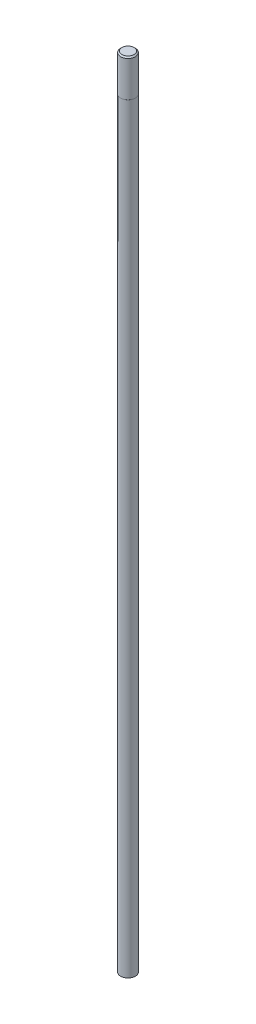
ISO-10303-21;
HEADER;
FILE_DESCRIPTION(('STEP AP214'),'2;1');
FILE_NAME('part.step','',(''),(''),'','','');
FILE_SCHEMA(('AUTOMOTIVE_DESIGN { 1 0 10303 214 1 1 1 1 }'));
ENDSEC;
DATA;
#1=APPLICATION_CONTEXT('core data for automotive mechanical design processes');
#2=APPLICATION_PROTOCOL_DEFINITION('international standard','automotive_design',2000,#1);
#3=PRODUCT_CONTEXT('',#1,'mechanical');
#4=PRODUCT('Part','Part','',(#3));
#5=PRODUCT_RELATED_PRODUCT_CATEGORY('part','',(#4));
#6=PRODUCT_DEFINITION_FORMATION('','',#4);
#7=PRODUCT_DEFINITION_CONTEXT('part definition',#1,'design');
#8=PRODUCT_DEFINITION('design','',#6,#7);
#9=PRODUCT_DEFINITION_SHAPE('','',#8);
#10=(LENGTH_UNIT() NAMED_UNIT(*) SI_UNIT(.MILLI.,.METRE.));
#11=(NAMED_UNIT(*) PLANE_ANGLE_UNIT() SI_UNIT($,.RADIAN.));
#12=(NAMED_UNIT(*) SI_UNIT($,.STERADIAN.) SOLID_ANGLE_UNIT());
#13=UNCERTAINTY_MEASURE_WITH_UNIT(LENGTH_MEASURE(1.E-05),#10,'distance_accuracy_value','');
#14=(GEOMETRIC_REPRESENTATION_CONTEXT(3) GLOBAL_UNCERTAINTY_ASSIGNED_CONTEXT((#13)) GLOBAL_UNIT_ASSIGNED_CONTEXT((#10,
#11,#12)) REPRESENTATION_CONTEXT('',''));
#15=CARTESIAN_POINT('',(0.,0.,0.));
#16=DIRECTION('',(0.,0.,1.));
#17=DIRECTION('',(1.,0.,0.));
#18=AXIS2_PLACEMENT_3D('',#15,#16,#17);
#19=CARTESIAN_POINT('',(0.,205.,0.));
#20=DIRECTION('',(0.,1.,0.));
#21=DIRECTION('',(0.,0.,1.));
#22=AXIS2_PLACEMENT_3D('',#19,#20,#21);
#23=PLANE('',#22);
#24=CARTESIAN_POINT('',(0.,205.,0.));
#25=DIRECTION('',(0.,1.,0.));
#26=DIRECTION('',(0.,0.,1.));
#27=AXIS2_PLACEMENT_3D('',#24,#25,#26);
#28=CIRCLE('',#27,2.);
#29=CARTESIAN_POINT('',(0.,205.,-2.));
#30=VERTEX_POINT('',#29);
#31=EDGE_CURVE('E43',#30,#30,#28,.T.);
#32=ORIENTED_EDGE('',*,*,#31,.T.);
#33=EDGE_LOOP('',(#32));
#34=FACE_BOUND('',#33,.T.);
#35=CARTESIAN_POINT('',(0.,205.,0.));
#36=DIRECTION('',(0.,1.,0.));
#37=DIRECTION('',(0.,0.,1.));
#38=AXIS2_PLACEMENT_3D('',#35,#36,#37);
#39=CIRCLE('',#38,1.99);
#40=CARTESIAN_POINT('',(0.,205.,1.99));
#41=VERTEX_POINT('',#40);
#42=EDGE_CURVE('E52',#41,#41,#39,.T.);
#43=ORIENTED_EDGE('',*,*,#42,.F.);
#44=EDGE_LOOP('',(#43));
#45=FACE_BOUND('',#44,.T.);
#46=ADVANCED_FACE('F32',(#34,#45),#23,.T.);
#47=CARTESIAN_POINT('',(0.,205.,0.));
#48=DIRECTION('',(0.,-1.,0.));
#49=DIRECTION('',(0.,0.,-1.));
#50=AXIS2_PLACEMENT_3D('',#47,#48,#49);
#51=CYLINDRICAL_SURFACE('',#50,2.);
#52=CARTESIAN_POINT('',(0.,0.,0.));
#53=DIRECTION('',(0.,1.,0.));
#54=DIRECTION('',(0.,0.,1.));
#55=AXIS2_PLACEMENT_3D('',#52,#53,#54);
#56=CIRCLE('',#55,2.);
#57=CARTESIAN_POINT('',(0.,0.,-2.));
#58=VERTEX_POINT('',#57);
#59=EDGE_CURVE('E47',#58,#58,#56,.T.);
#60=CARTESIAN_POINT('',(0.,205.,-2.));
#61=CARTESIAN_POINT('',(0.,202.864583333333,-2.));
#62=CARTESIAN_POINT('',(0.,200.729166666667,-2.));
#63=CARTESIAN_POINT('',(0.,196.458333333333,-2.));
#64=CARTESIAN_POINT('',(0.,194.322916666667,-2.));
#65=CARTESIAN_POINT('',(0.,190.052083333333,-2.));
#66=CARTESIAN_POINT('',(0.,187.916666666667,-2.));
#67=CARTESIAN_POINT('',(0.,183.645833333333,-2.));
#68=CARTESIAN_POINT('',(0.,181.510416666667,-2.));
#69=CARTESIAN_POINT('',(0.,177.239583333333,-2.));
#70=CARTESIAN_POINT('',(0.,175.104166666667,-2.));
#71=CARTESIAN_POINT('',(0.,170.833333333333,-2.));
#72=CARTESIAN_POINT('',(0.,168.697916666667,-2.));
#73=CARTESIAN_POINT('',(0.,164.427083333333,-2.));
#74=CARTESIAN_POINT('',(0.,162.291666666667,-2.));
#75=CARTESIAN_POINT('',(0.,158.020833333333,-2.));
#76=CARTESIAN_POINT('',(0.,155.885416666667,-2.));
#77=CARTESIAN_POINT('',(0.,151.614583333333,-2.));
#78=CARTESIAN_POINT('',(0.,149.479166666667,-2.));
#79=CARTESIAN_POINT('',(0.,145.208333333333,-2.));
#80=CARTESIAN_POINT('',(0.,143.072916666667,-2.));
#81=CARTESIAN_POINT('',(0.,138.802083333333,-2.));
#82=CARTESIAN_POINT('',(0.,136.666666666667,-2.));
#83=CARTESIAN_POINT('',(0.,132.395833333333,-2.));
#84=CARTESIAN_POINT('',(0.,130.260416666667,-2.));
#85=CARTESIAN_POINT('',(0.,125.989583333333,-2.));
#86=CARTESIAN_POINT('',(0.,123.854166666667,-2.));
#87=CARTESIAN_POINT('',(0.,119.583333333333,-2.));
#88=CARTESIAN_POINT('',(0.,117.447916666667,-2.));
#89=CARTESIAN_POINT('',(0.,113.177083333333,-2.));
#90=CARTESIAN_POINT('',(0.,111.041666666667,-2.));
#91=CARTESIAN_POINT('',(0.,106.770833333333,-2.));
#92=CARTESIAN_POINT('',(0.,104.635416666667,-2.));
#93=CARTESIAN_POINT('',(0.,100.364583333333,-2.));
#94=CARTESIAN_POINT('',(0.,98.2291666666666,-2.));
#95=CARTESIAN_POINT('',(0.,93.9583333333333,-2.));
#96=CARTESIAN_POINT('',(0.,91.8229166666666,-2.));
#97=CARTESIAN_POINT('',(0.,87.5520833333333,-2.));
#98=CARTESIAN_POINT('',(0.,85.4166666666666,-2.));
#99=CARTESIAN_POINT('',(0.,81.1458333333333,-2.));
#100=CARTESIAN_POINT('',(0.,79.0104166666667,-2.));
#101=CARTESIAN_POINT('',(0.,74.7395833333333,-2.));
#102=CARTESIAN_POINT('',(0.,72.6041666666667,-2.));
#103=CARTESIAN_POINT('',(0.,68.3333333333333,-2.));
#104=CARTESIAN_POINT('',(0.,66.1979166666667,-2.));
#105=CARTESIAN_POINT('',(0.,61.9270833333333,-2.));
#106=CARTESIAN_POINT('',(0.,59.7916666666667,-2.));
#107=CARTESIAN_POINT('',(0.,55.5208333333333,-2.));
#108=CARTESIAN_POINT('',(0.,53.3854166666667,-2.));
#109=CARTESIAN_POINT('',(0.,49.1145833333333,-2.));
#110=CARTESIAN_POINT('',(0.,46.9791666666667,-2.));
#111=CARTESIAN_POINT('',(0.,42.7083333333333,-2.));
#112=CARTESIAN_POINT('',(0.,40.5729166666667,-2.));
#113=CARTESIAN_POINT('',(0.,36.3020833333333,-2.));
#114=CARTESIAN_POINT('',(0.,34.1666666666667,-2.));
#115=CARTESIAN_POINT('',(0.,29.8958333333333,-2.));
#116=CARTESIAN_POINT('',(0.,27.7604166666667,-2.));
#117=CARTESIAN_POINT('',(0.,23.4895833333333,-2.));
#118=CARTESIAN_POINT('',(0.,21.3541666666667,-2.));
#119=CARTESIAN_POINT('',(0.,17.0833333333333,-2.));
#120=CARTESIAN_POINT('',(0.,14.9479166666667,-2.));
#121=CARTESIAN_POINT('',(0.,10.6770833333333,-2.));
#122=CARTESIAN_POINT('',(0.,8.54166666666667,-2.));
#123=CARTESIAN_POINT('',(0.,4.27083333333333,-2.));
#124=CARTESIAN_POINT('',(0.,2.13541666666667,-2.));
#125=CARTESIAN_POINT('',(0.,0.,-2.));
#126=B_SPLINE_CURVE_WITH_KNOTS('',3,(#60,#61,#62,#63,#64,#65,#66,#67,#68,#69,#70,#71,#72,#73,
#74,#75,#76,#77,#78,#79,#80,#81,#82,#83,#84,#85,#86,#87,#88,#89,#90,#91,#92,#93,#94,#95,#96,#97,
#98,#99,#100,#101,#102,#103,#104,#105,#106,#107,#108,#109,#110,#111,#112,#113,#114,#115,#116,
#117,#118,#119,#120,#121,#122,#123,#124,#125),.UNSPECIFIED.,.F.,.F.,(4,2,2,2,2,2,2,2,2,2,2,2,2,
2,2,2,2,2,2,2,2,2,2,2,2,2,2,2,2,2,2,2,4),(0.,6.40625,12.8125,19.21875,25.625,32.03125,38.4375,
44.84375,51.25,57.65625,64.0625,70.46875,76.875,83.28125,89.6875,96.09375,102.5,108.90625,
115.3125,121.71875,128.125,134.53125,140.9375,147.34375,153.75,160.15625,166.5625,172.96875,
179.375,185.78125,192.1875,198.59375,205.),.UNSPECIFIED.);
#127=EDGE_CURVE('BSEAM34',#30,#58,#126,.T.);
#128=ORIENTED_EDGE('',*,*,#31,.F.);
#129=ORIENTED_EDGE('',*,*,#59,.T.);
#130=ORIENTED_EDGE('',*,*,#127,.T.);
#131=ORIENTED_EDGE('',*,*,#127,.F.);
#132=EDGE_LOOP('',(#128,#130,#129,#131));
#133=FACE_BOUND('',#132,.T.);
#134=ADVANCED_FACE('F34',(#133),#51,.T.);
#135=CARTESIAN_POINT('',(0.,0.,0.));
#136=DIRECTION('',(0.,1.,0.));
#137=DIRECTION('',(0.,0.,1.));
#138=AXIS2_PLACEMENT_3D('',#135,#136,#137);
#139=PLANE('',#138);
#140=ORIENTED_EDGE('',*,*,#59,.F.);
#141=EDGE_LOOP('',(#140));
#142=FACE_BOUND('',#141,.T.);
#143=ADVANCED_FACE('F63',(#142),#139,.F.);
#144=CARTESIAN_POINT('',(0.,215.,0.));
#145=DIRECTION('',(0.,-1.,0.));
#146=DIRECTION('',(0.,0.,-1.));
#147=AXIS2_PLACEMENT_3D('',#144,#145,#146);
#148=CYLINDRICAL_SURFACE('',#147,1.99);
#149=CARTESIAN_POINT('',(0.,214.65,0.));
#150=DIRECTION('',(0.,1.,0.));
#151=DIRECTION('',(0.,0.,1.));
#152=AXIS2_PLACEMENT_3D('',#149,#150,#151);
#153=CIRCLE('',#152,1.99);
#154=CARTESIAN_POINT('',(0.,214.65,1.99));
#155=VERTEX_POINT('',#154);
#156=EDGE_CURVE('E10',#155,#155,#153,.F.);
#157=ORIENTED_EDGE('',*,*,#156,.T.);
#158=EDGE_LOOP('',(#157));
#159=FACE_BOUND('',#158,.T.);
#160=ORIENTED_EDGE('',*,*,#42,.T.);
#161=EDGE_LOOP('',(#160));
#162=FACE_BOUND('',#161,.T.);
#163=ADVANCED_FACE('F56',(#159,#162),#148,.T.);
#164=CARTESIAN_POINT('',(0.,215.,0.));
#165=DIRECTION('',(0.,1.,0.));
#166=DIRECTION('',(0.,0.,1.));
#167=AXIS2_PLACEMENT_3D('',#164,#165,#166);
#168=PLANE('',#167);
#169=CARTESIAN_POINT('',(0.,215.,0.));
#170=DIRECTION('',(0.,1.,0.));
#171=DIRECTION('',(0.,0.,1.));
#172=AXIS2_PLACEMENT_3D('',#169,#170,#171);
#173=CIRCLE('',#172,1.64);
#174=CARTESIAN_POINT('',(0.,215.,1.64));
#175=VERTEX_POINT('',#174);
#176=EDGE_CURVE('E39',#175,#175,#173,.T.);
#177=ORIENTED_EDGE('',*,*,#176,.T.);
#178=EDGE_LOOP('',(#177));
#179=FACE_BOUND('',#178,.T.);
#180=ADVANCED_FACE('F71',(#179),#168,.T.);
#181=CARTESIAN_POINT('',(0.,215.,0.));
#182=DIRECTION('',(0.,-1.,0.));
#183=DIRECTION('',(0.,0.,-1.));
#184=AXIS2_PLACEMENT_3D('',#181,#182,#183);
#185=CONICAL_SURFACE('',#184,1.64,0.78539816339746);
#186=ORIENTED_EDGE('',*,*,#156,.F.);
#187=EDGE_LOOP('',(#186));
#188=FACE_BOUND('',#187,.T.);
#189=ORIENTED_EDGE('',*,*,#176,.F.);
#190=EDGE_LOOP('',(#189));
#191=FACE_BOUND('',#190,.T.);
#192=ADVANCED_FACE('F74',(#188,#191),#185,.T.);
#193=CLOSED_SHELL('',(#46,#134,#143,#163,#180,#192));
#194=MANIFOLD_SOLID_BREP('B2',#193);
#195=ADVANCED_BREP_SHAPE_REPRESENTATION('',(#18,#194),#14);
#196=SHAPE_DEFINITION_REPRESENTATION(#9,#195);
ENDSEC;
END-ISO-10303-21;
